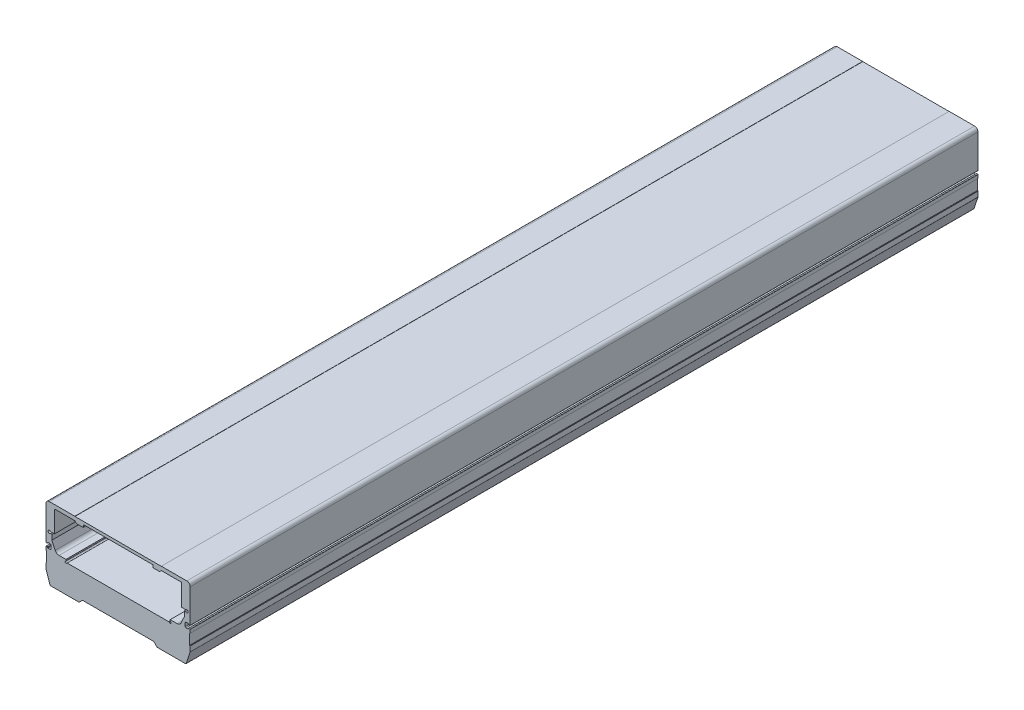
from build123d import *

# Parameters (mm, degrees)
EXTRUDE_1_DEPTH      = 929
HOLE_WIZARD_M8_D     = 6.8
HOLE_WIZARD_M8_DEPTH = 19.75
HOLE_WIZARD_M8_TIP   = 2.042926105


with BuildPart() as part:
    # Sketch 1 → Extrude 1 (new body)
    with BuildSketch(Plane.XY):
        with BuildLine():
            Line((81, 81.3), (51, 81.3))
            Line((51, 81.3), (50.868986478, 81.168986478))
            Line((50.868986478, 81.168986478), (-50.868986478, 81.168986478))
            Line((-50.868986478, 81.168986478), (-51, 81.3))
            Line((-51, 81.3), (-81, 81.3))
            ThreePointArc((-81, 81.3), (-83.828427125, 80.128427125), (-85, 77.3))
            Line((-85, 77.3), (-85, 37.9))
            ThreePointArc((-85, 37.9), (-84.912132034, 37.687867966), (-84.7, 37.6))
            Line((-84.7, 37.6), (-83.3, 37.6))
            ThreePointArc((-83.3, 37.6), (-83.087867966, 37.687867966), (-83, 37.9))
            Line((-83, 37.9), (-83, 38.4))
            ThreePointArc((-83, 38.4), (-82.912132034, 38.612132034), (-82.7, 38.7))
            Line((-82.7, 38.7), (-80.2, 38.7))
            ThreePointArc((-80.2, 38.7), (-79.492893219, 38.407106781), (-79.2, 37.7))
            Line((-79.2, 37.7), (-79.2, 33.9))
            ThreePointArc((-79.2, 33.9), (-79.492893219, 33.192893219), (-80.2, 32.9))
            Line((-80.2, 32.9), (-82.7, 32.9))
            ThreePointArc((-82.7, 32.9), (-82.912132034, 32.987867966), (-83, 33.2))
            Line((-83, 33.2), (-83, 33.7))
            ThreePointArc((-83, 33.7), (-83.087867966, 33.912132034), (-83.3, 34))
            Line((-83.3, 34), (-84.7, 34))
            ThreePointArc((-84.7, 34), (-84.912132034, 33.912132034), (-85, 33.7))
            Line((-85, 33.7), (-85, 29.8))
            Line((-85, 29.8), (-84.5, 29.3))
            Line((-84.5, 29.3), (-84.5, 17.3))
            Line((-84.5, 17.3), (-85, 16.8))
            Line((-85, 16.8), (-85, 10.86227766))
            ThreePointArc((-85, 10.86227766), (-84.987087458, 10.702095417), (-84.948683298, 10.546049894))
            Line((-84.948683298, 10.546049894), (-80.327924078, -3.316227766))
            ThreePointArc((-80.327924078, -3.316227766), (-79.963951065, -3.811242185), (-79.37924078, -4))
            Line((-79.37924078, -4), (-46, -4))
            Line((-46, -4), (-42, 0))
            Line((-42, 0), (42, 0))
            Line((42, 0), (46, -4))
            Line((46, -4), (79.37924078, -4))
            ThreePointArc((79.37924078, -4), (79.963951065, -3.811242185), (80.327924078, -3.316227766))
            Line((80.327924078, -3.316227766), (84.948683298, 10.546049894))
            ThreePointArc((84.948683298, 10.546049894), (84.987087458, 10.702095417), (85, 10.86227766))
            Line((85, 10.86227766), (85, 16.8))
            Line((85, 16.8), (84.5, 17.3))
            Line((84.5, 17.3), (84.5, 29.3))
            Line((84.5, 29.3), (85, 29.8))
            Line((85, 29.8), (85, 33.7))
            ThreePointArc((85, 33.7), (84.912132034, 33.912132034), (84.7, 34))
            Line((84.7, 34), (83.3, 34))
            ThreePointArc((83.3, 34), (83.087867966, 33.912132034), (83, 33.7))
            Line((83, 33.7), (83, 33.2))
            ThreePointArc((83, 33.2), (82.912132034, 32.987867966), (82.7, 32.9))
            Line((82.7, 32.9), (80.2, 32.9))
            ThreePointArc((80.2, 32.9), (79.492893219, 33.192893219), (79.2, 33.9))
            Line((79.2, 33.9), (79.2, 37.7))
            ThreePointArc((79.2, 37.7), (79.492893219, 38.407106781), (80.2, 38.7))
            Line((80.2, 38.7), (82.7, 38.7))
            ThreePointArc((82.7, 38.7), (82.912132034, 38.612132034), (83, 38.4))
            Line((83, 38.4), (83, 37.9))
            ThreePointArc((83, 37.9), (83.087867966, 37.687867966), (83.3, 37.6))
            Line((83.3, 37.6), (84.7, 37.6))
            ThreePointArc((84.7, 37.6), (84.912132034, 37.687867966), (85, 37.9))
            Line((85, 37.9), (85, 77.3))
            ThreePointArc((85, 77.3), (83.828427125, 80.128427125), (81, 81.3))
        make_face()
        with BuildLine():
            Line((49, 74.8), (41.3, 74.8))
            ThreePointArc((41.3, 74.8), (41.087867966, 74.887867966), (41, 75.1))
            Line((41, 75.1), (41, 77.8))
            Line((41, 77.8), (-41, 77.8))
            Line((-41, 77.8), (-41, 75.1))
            ThreePointArc((-41, 75.1), (-41.087867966, 74.887867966), (-41.3, 74.8))
            Line((-41.3, 74.8), (-49, 74.8))
            Line((-49, 74.8), (-51, 76.8))
            Line((-51, 76.8), (-74, 76.8))
            ThreePointArc((-74, 76.8), (-74.707106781, 76.507106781), (-75, 75.8))
            Line((-75, 75.8), (-75, 51.3))
            Line((-75, 51.3), (-79.687559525, 51.3))
            ThreePointArc((-79.687559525, 51.3), (-82.65, 50.3), (-79.687559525, 49.3))
            Line((-79.687559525, 49.3), (-78.1, 49.3))
            Line((-78.1, 49.3), (-78.1, 43.3))
            Line((-78.1, 43.3), (-74.176911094, 34.886908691))
            ThreePointArc((-74.176911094, 34.886908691), (-72.331870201, 32.783042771), (-69.645372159, 32))
            Line((-69.645372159, 32), (-61.5, 32))
            Line((-61.5, 32), (-61.5, 30.414213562))
            Line((-61.5, 30.414213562), (-62.207106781, 29.707106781))
            ThreePointArc((-62.207106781, 29.707106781), (-62.207106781, 28.292893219), (-60.792893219, 28.292893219))
            Line((-60.792893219, 28.292893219), (-60.085786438, 29))
            Line((-60.085786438, 29), (60.085786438, 29))
            Line((60.085786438, 29), (60.792893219, 28.292893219))
            ThreePointArc((60.792893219, 28.292893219), (62.207106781, 28.292893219), (62.207106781, 29.707106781))
            Line((62.207106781, 29.707106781), (61.5, 30.414213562))
            Line((61.5, 30.414213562), (61.5, 32))
            Line((61.5, 32), (69.645372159, 32))
            ThreePointArc((69.645372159, 32), (72.331870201, 32.783042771), (74.176911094, 34.886908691))
            Line((74.176911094, 34.886908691), (78.1, 43.3))
            Line((78.1, 43.3), (78.1, 49.3))
            Line((78.1, 49.3), (79.687559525, 49.3))
            ThreePointArc((79.687559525, 49.3), (82.65, 50.3), (79.687559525, 51.3))
            Line((79.687559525, 51.3), (75, 51.3))
            Line((75, 51.3), (75, 75.8))
            ThreePointArc((75, 75.8), (74.707106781, 76.507106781), (74, 76.8))
            Line((74, 76.8), (51, 76.8))
            Line((51, 76.8), (49, 74.8))
        make_face(mode=Mode.SUBTRACT)
    extrude(amount=-EXTRUDE_1_DEPTH)

    # Hole Wizard M8
    with Locations(Plane(origin=(0, -4, 0), x_dir=(-1, 0, 0), z_dir=(0, -1, 0))):
        with Locations((70, 870.5), (-70, 870.5), (70, 670.5), (-70, 670.5), (-70, 470.5), (70, 470.5), (-70, 270.5), (70, 270.5), (-70, 70.5), (70, 70.5), (-70, -129.5), (70, -129.5), (70, -329.5), (-70, -329.5), (-70, -529.5), (70, -529.5)):
            Hole(HOLE_WIZARD_M8_D / 2, depth=HOLE_WIZARD_M8_DEPTH)
            with Locations((0, 0, -(HOLE_WIZARD_M8_DEPTH + HOLE_WIZARD_M8_TIP / 2))):  # 118° drill point
                Cone(0, HOLE_WIZARD_M8_D / 2, HOLE_WIZARD_M8_TIP, mode=Mode.SUBTRACT)


solid = part.part
